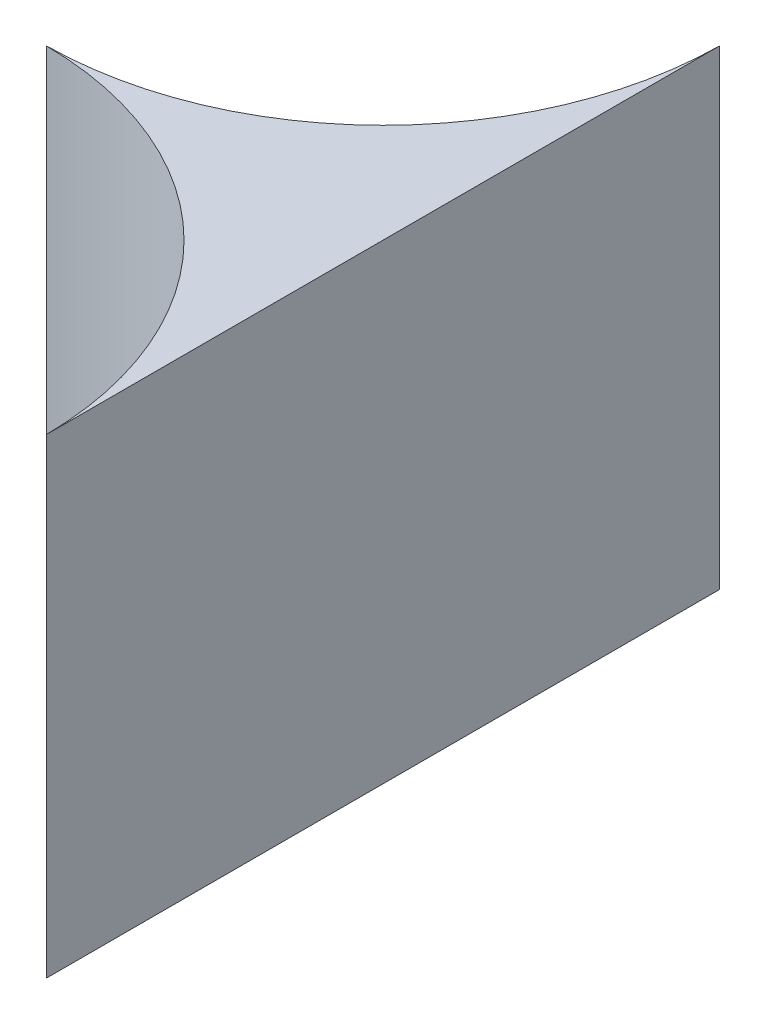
from build123d import *

# Parameters (mm, degrees)
BOSS_EXTRUDE1_DEPTH = 35
SKETCH2_W           = 25.251237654
SKETCH2_H           = 50.25
CUT_EXTRUDE1_DEPTH  = 50.749371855
SCALE1_SCALE        = 0.9


with BuildPart() as part:
    # Sketch1 → Boss-Extrude1 (new body)
    with BuildSketch(Plane(origin=(0, 0, 0), x_dir=(1, 0, 0), z_dir=(0, 1, 0))):
        with BuildLine():
            ThreePointArc((-25, -0.001237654), (-7.395553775, -7.395553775), (-0.001237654, -25))
            Line((-0.001237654, -25), (0.001237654, -25))
            ThreePointArc((0.001237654, -25), (7.395553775, -7.395553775), (25, -0.001237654))
            Line((25, -0.001237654), (25, 0.001237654))
            ThreePointArc((25, 0.001237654), (7.395553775, 7.395553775), (0.001237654, 25))
            Line((0.001237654, 25), (-0.001237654, 25))
            ThreePointArc((-0.001237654, 25), (-7.395553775, 7.395553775), (-25, 0.001237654))
            Line((-25, 0.001237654), (-25, -0.001237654))
        make_face()
    extrude(amount=BOSS_EXTRUDE1_DEPTH)

    # Sketch2 → Cut-Extrude1 (cut, through all)
    with BuildSketch(Plane.XZ):
        with Locations((12.624381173, -0.125)):
            Rectangle(SKETCH2_W, SKETCH2_H)
    extrude(amount=-CUT_EXTRUDE1_DEPTH, mode=Mode.SUBTRACT)


with BuildPart() as part_1:
    # Scale1: scaled about (-5.641305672, 17.5, 0)
    add(part.part.scale(SCALE1_SCALE).moved(Location((-0.564130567, 1.75, 0))))


solid = part_1.part
